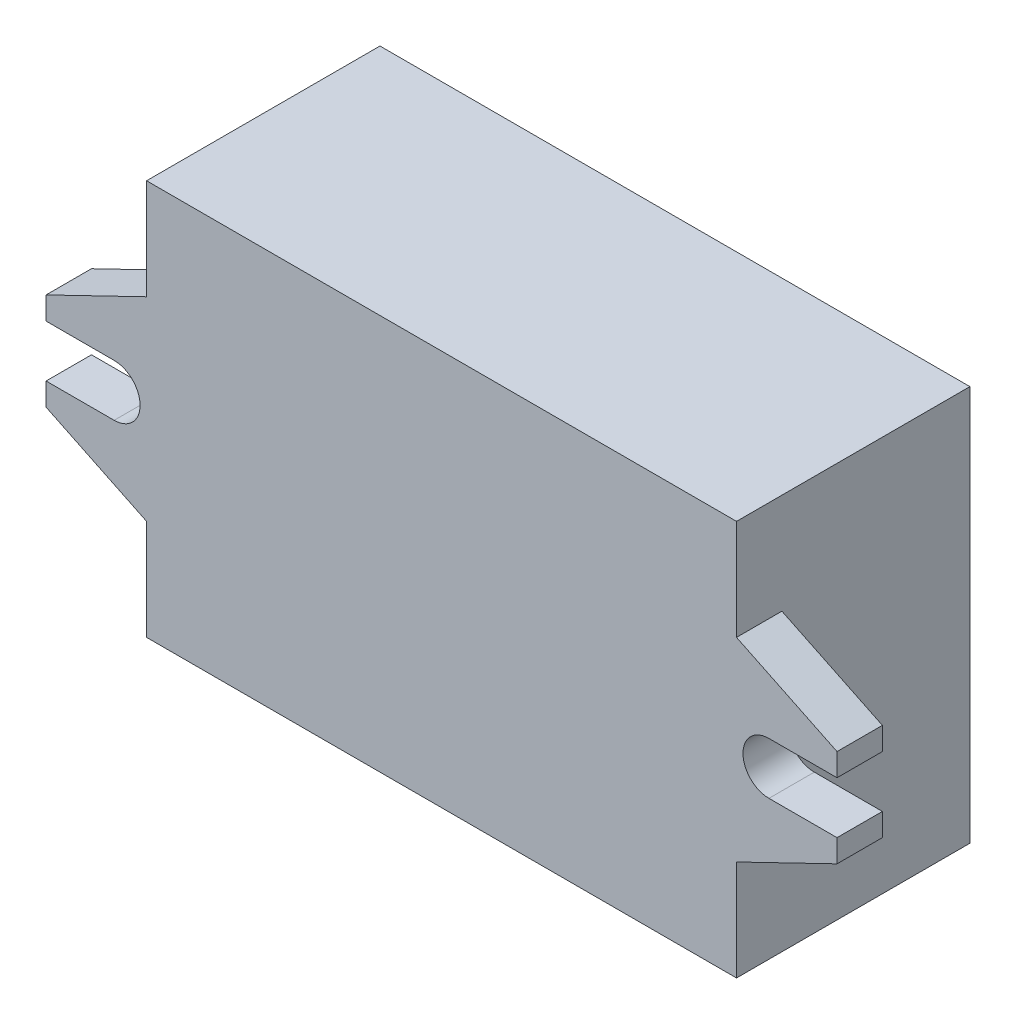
ISO-10303-21;
HEADER;
FILE_DESCRIPTION(('STEP AP214'),'2;1');
FILE_NAME('part.step','',(''),(''),'','','');
FILE_SCHEMA(('AUTOMOTIVE_DESIGN { 1 0 10303 214 1 1 1 1 }'));
ENDSEC;
DATA;
#1=APPLICATION_CONTEXT('core data for automotive mechanical design processes');
#2=APPLICATION_PROTOCOL_DEFINITION('international standard','automotive_design',2000,#1);
#3=PRODUCT_CONTEXT('',#1,'mechanical');
#4=PRODUCT('Part','Part','',(#3));
#5=PRODUCT_RELATED_PRODUCT_CATEGORY('part','',(#4));
#6=PRODUCT_DEFINITION_FORMATION('','',#4);
#7=PRODUCT_DEFINITION_CONTEXT('part definition',#1,'design');
#8=PRODUCT_DEFINITION('design','',#6,#7);
#9=PRODUCT_DEFINITION_SHAPE('','',#8);
#10=(LENGTH_UNIT() NAMED_UNIT(*) SI_UNIT(.MILLI.,.METRE.));
#11=(NAMED_UNIT(*) PLANE_ANGLE_UNIT() SI_UNIT($,.RADIAN.));
#12=(NAMED_UNIT(*) SI_UNIT($,.STERADIAN.) SOLID_ANGLE_UNIT());
#13=UNCERTAINTY_MEASURE_WITH_UNIT(LENGTH_MEASURE(1.E-05),#10,'distance_accuracy_value','');
#14=(GEOMETRIC_REPRESENTATION_CONTEXT(3) GLOBAL_UNCERTAINTY_ASSIGNED_CONTEXT((#13)) GLOBAL_UNIT_ASSIGNED_CONTEXT((#10,
#11,#12)) REPRESENTATION_CONTEXT('',''));
#15=CARTESIAN_POINT('',(0.,0.,0.));
#16=DIRECTION('',(0.,0.,1.));
#17=DIRECTION('',(1.,0.,0.));
#18=AXIS2_PLACEMENT_3D('',#15,#16,#17);
#19=CARTESIAN_POINT('',(0.,30.988,18.288));
#20=DIRECTION('',(1.,0.,0.));
#21=DIRECTION('',(0.,0.,-1.));
#22=AXIS2_PLACEMENT_3D('',#19,#20,#21);
#23=PLANE('',#22);
#24=DIRECTION('',(0.,0.,1.));
#25=VECTOR('',#24,1.);
#26=CARTESIAN_POINT('',(0.,7.874,14.732));
#27=LINE('',#26,#25);
#28=CARTESIAN_POINT('',(0.,7.874,14.732));
#29=VERTEX_POINT('',#28);
#30=CARTESIAN_POINT('',(0.,7.874,18.288));
#31=VERTEX_POINT('',#30);
#32=EDGE_CURVE('E230',#29,#31,#27,.T.);
#33=ORIENTED_EDGE('',*,*,#32,.F.);
#34=DIRECTION('',(0.,1.,0.));
#35=VECTOR('',#34,1.);
#36=CARTESIAN_POINT('',(0.,23.114,14.732));
#37=LINE('',#36,#35);
#38=CARTESIAN_POINT('',(0.,23.114,14.732));
#39=VERTEX_POINT('',#38);
#40=EDGE_CURVE('E179',#29,#39,#37,.T.);
#41=ORIENTED_EDGE('',*,*,#40,.T.);
#42=DIRECTION('',(0.,0.,1.));
#43=VECTOR('',#42,1.);
#44=CARTESIAN_POINT('',(0.,23.114,14.732));
#45=LINE('',#44,#43);
#46=CARTESIAN_POINT('',(0.,23.114,18.288));
#47=VERTEX_POINT('',#46);
#48=EDGE_CURVE('E193',#39,#47,#45,.T.);
#49=ORIENTED_EDGE('',*,*,#48,.T.);
#50=DIRECTION('',(0.,-1.,0.));
#51=VECTOR('',#50,1.);
#52=CARTESIAN_POINT('',(0.,30.988,18.288));
#53=LINE('',#52,#51);
#54=CARTESIAN_POINT('',(0.,30.988,18.288));
#55=VERTEX_POINT('',#54);
#56=EDGE_CURVE('E321',#55,#47,#53,.T.);
#57=ORIENTED_EDGE('',*,*,#56,.F.);
#58=DIRECTION('',(0.,0.,-1.));
#59=VECTOR('',#58,1.);
#60=CARTESIAN_POINT('',(0.,30.988,18.288));
#61=LINE('',#60,#59);
#62=CARTESIAN_POINT('',(0.,30.988,0.));
#63=VERTEX_POINT('',#62);
#64=EDGE_CURVE('E336',#55,#63,#61,.T.);
#65=ORIENTED_EDGE('',*,*,#64,.T.);
#66=DIRECTION('',(0.,-1.,0.));
#67=VECTOR('',#66,1.);
#68=CARTESIAN_POINT('',(0.,30.988,0.));
#69=LINE('',#68,#67);
#70=CARTESIAN_POINT('',(0.,0.,0.));
#71=VERTEX_POINT('',#70);
#72=EDGE_CURVE('E314',#63,#71,#69,.T.);
#73=ORIENTED_EDGE('',*,*,#72,.T.);
#74=DIRECTION('',(0.,0.,-1.));
#75=VECTOR('',#74,1.);
#76=CARTESIAN_POINT('',(0.,0.,18.288));
#77=LINE('',#76,#75);
#78=CARTESIAN_POINT('',(0.,0.,18.288));
#79=VERTEX_POINT('',#78);
#80=EDGE_CURVE('E11',#79,#71,#77,.T.);
#81=ORIENTED_EDGE('',*,*,#80,.F.);
#82=EDGE_CURVE('E325',#31,#79,#53,.T.);
#83=ORIENTED_EDGE('',*,*,#82,.F.);
#84=EDGE_LOOP('',(#33,#41,#49,#57,#65,#73,#81,#83));
#85=FACE_BOUND('',#84,.T.);
#86=ADVANCED_FACE('F33',(#85),#23,.F.);
#87=CARTESIAN_POINT('',(46.228,30.988,18.288));
#88=DIRECTION('',(-1.,0.,0.));
#89=DIRECTION('',(0.,0.,1.));
#90=AXIS2_PLACEMENT_3D('',#87,#88,#89);
#91=PLANE('',#90);
#92=DIRECTION('',(0.,0.,1.));
#93=VECTOR('',#92,1.);
#94=CARTESIAN_POINT('',(46.228,23.114,14.732));
#95=LINE('',#94,#93);
#96=CARTESIAN_POINT('',(46.228,23.114,14.732));
#97=VERTEX_POINT('',#96);
#98=CARTESIAN_POINT('',(46.228,23.114,18.288));
#99=VERTEX_POINT('',#98);
#100=EDGE_CURVE('E292',#97,#99,#95,.T.);
#101=ORIENTED_EDGE('',*,*,#100,.F.);
#102=DIRECTION('',(0.,-1.,0.));
#103=VECTOR('',#102,1.);
#104=CARTESIAN_POINT('',(46.228,23.114,14.732));
#105=LINE('',#104,#103);
#106=CARTESIAN_POINT('',(46.228,7.874,14.732));
#107=VERTEX_POINT('',#106);
#108=EDGE_CURVE('E250',#97,#107,#105,.T.);
#109=ORIENTED_EDGE('',*,*,#108,.T.);
#110=DIRECTION('',(0.,0.,1.));
#111=VECTOR('',#110,1.);
#112=CARTESIAN_POINT('',(46.228,7.874,14.732));
#113=LINE('',#112,#111);
#114=CARTESIAN_POINT('',(46.228,7.874,18.288));
#115=VERTEX_POINT('',#114);
#116=EDGE_CURVE('E274',#107,#115,#113,.T.);
#117=ORIENTED_EDGE('',*,*,#116,.T.);
#118=DIRECTION('',(0.,1.,0.));
#119=VECTOR('',#118,1.);
#120=CARTESIAN_POINT('',(46.228,30.988,18.288));
#121=LINE('',#120,#119);
#122=CARTESIAN_POINT('',(46.228,0.,18.288));
#123=VERTEX_POINT('',#122);
#124=EDGE_CURVE('E569',#123,#115,#121,.T.);
#125=ORIENTED_EDGE('',*,*,#124,.F.);
#126=DIRECTION('',(0.,0.,-1.));
#127=VECTOR('',#126,1.);
#128=CARTESIAN_POINT('',(46.228,0.,18.288));
#129=LINE('',#128,#127);
#130=CARTESIAN_POINT('',(46.228,0.,0.));
#131=VERTEX_POINT('',#130);
#132=EDGE_CURVE('E41',#123,#131,#129,.T.);
#133=ORIENTED_EDGE('',*,*,#132,.T.);
#134=DIRECTION('',(0.,1.,0.));
#135=VECTOR('',#134,1.);
#136=CARTESIAN_POINT('',(46.228,30.988,0.));
#137=LINE('',#136,#135);
#138=CARTESIAN_POINT('',(46.228,30.988,0.));
#139=VERTEX_POINT('',#138);
#140=EDGE_CURVE('E584',#131,#139,#137,.T.);
#141=ORIENTED_EDGE('',*,*,#140,.T.);
#142=DIRECTION('',(0.,0.,-1.));
#143=VECTOR('',#142,1.);
#144=CARTESIAN_POINT('',(46.228,30.988,18.288));
#145=LINE('',#144,#143);
#146=CARTESIAN_POINT('',(46.228,30.988,18.288));
#147=VERTEX_POINT('',#146);
#148=EDGE_CURVE('E579',#147,#139,#145,.T.);
#149=ORIENTED_EDGE('',*,*,#148,.F.);
#150=EDGE_CURVE('E568',#99,#147,#121,.T.);
#151=ORIENTED_EDGE('',*,*,#150,.F.);
#152=EDGE_LOOP('',(#101,#109,#117,#125,#133,#141,#149,#151));
#153=FACE_BOUND('',#152,.T.);
#154=ADVANCED_FACE('F359',(#153),#91,.F.);
#155=CARTESIAN_POINT('',(0.,0.,18.288));
#156=DIRECTION('',(0.,1.,0.));
#157=DIRECTION('',(0.,0.,1.));
#158=AXIS2_PLACEMENT_3D('',#155,#156,#157);
#159=PLANE('',#158);
#160=DIRECTION('',(1.,0.,0.));
#161=VECTOR('',#160,1.);
#162=CARTESIAN_POINT('',(0.,0.,0.));
#163=LINE('',#162,#161);
#164=EDGE_CURVE('E564',#71,#131,#163,.T.);
#165=ORIENTED_EDGE('',*,*,#164,.T.);
#166=ORIENTED_EDGE('',*,*,#132,.F.);
#167=DIRECTION('',(1.,0.,0.));
#168=VECTOR('',#167,1.);
#169=CARTESIAN_POINT('',(0.,0.,18.288));
#170=LINE('',#169,#168);
#171=EDGE_CURVE('E324',#79,#123,#170,.T.);
#172=ORIENTED_EDGE('',*,*,#171,.F.);
#173=ORIENTED_EDGE('',*,*,#80,.T.);
#174=EDGE_LOOP('',(#165,#166,#172,#173));
#175=FACE_BOUND('',#174,.T.);
#176=ADVANCED_FACE('F363',(#175),#159,.F.);
#177=CARTESIAN_POINT('',(0.,30.988,18.288));
#178=DIRECTION('',(0.,-1.,0.));
#179=DIRECTION('',(1.,0.,0.));
#180=AXIS2_PLACEMENT_3D('',#177,#178,#179);
#181=PLANE('',#180);
#182=DIRECTION('',(-1.,0.,0.));
#183=VECTOR('',#182,1.);
#184=CARTESIAN_POINT('',(0.,30.988,0.));
#185=LINE('',#184,#183);
#186=EDGE_CURVE('E326',#139,#63,#185,.T.);
#187=ORIENTED_EDGE('',*,*,#186,.T.);
#188=ORIENTED_EDGE('',*,*,#64,.F.);
#189=DIRECTION('',(-1.,0.,0.));
#190=VECTOR('',#189,1.);
#191=CARTESIAN_POINT('',(0.,30.988,18.288));
#192=LINE('',#191,#190);
#193=EDGE_CURVE('E331',#147,#55,#192,.T.);
#194=ORIENTED_EDGE('',*,*,#193,.F.);
#195=ORIENTED_EDGE('',*,*,#148,.T.);
#196=EDGE_LOOP('',(#187,#188,#194,#195));
#197=FACE_BOUND('',#196,.T.);
#198=ADVANCED_FACE('F369',(#197),#181,.F.);
#199=CARTESIAN_POINT('',(0.,0.,18.288));
#200=DIRECTION('',(0.,0.,1.));
#201=DIRECTION('',(1.,0.,0.));
#202=AXIS2_PLACEMENT_3D('',#199,#200,#201);
#203=PLANE('',#202);
#204=ORIENTED_EDGE('',*,*,#56,.T.);
#205=DIRECTION('',(-0.900159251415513,-0.435560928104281,0.));
#206=VECTOR('',#205,1.);
#207=CARTESIAN_POINT('',(0.,23.114,18.288));
#208=LINE('',#207,#206);
#209=CARTESIAN_POINT('',(-7.87399999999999,19.304,18.288));
#210=VERTEX_POINT('',#209);
#211=EDGE_CURVE('E49',#47,#210,#208,.T.);
#212=ORIENTED_EDGE('',*,*,#211,.T.);
#213=DIRECTION('',(0.,-1.,0.));
#214=VECTOR('',#213,1.);
#215=CARTESIAN_POINT('',(-7.87399999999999,19.304,18.288));
#216=LINE('',#215,#214);
#217=CARTESIAN_POINT('',(-7.87399999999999,17.526,18.288));
#218=VERTEX_POINT('',#217);
#219=EDGE_CURVE('E176',#210,#218,#216,.T.);
#220=ORIENTED_EDGE('',*,*,#219,.T.);
#221=DIRECTION('',(1.,0.,0.));
#222=VECTOR('',#221,1.);
#223=CARTESIAN_POINT('',(-7.87399999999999,17.526,18.288));
#224=LINE('',#223,#222);
#225=CARTESIAN_POINT('',(-2.54000000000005,17.526,18.288));
#226=VERTEX_POINT('',#225);
#227=EDGE_CURVE('E212',#218,#226,#224,.T.);
#228=ORIENTED_EDGE('',*,*,#227,.T.);
#229=CARTESIAN_POINT('',(-2.54000000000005,15.494,18.288));
#230=DIRECTION('',(0.,0.,-1.));
#231=DIRECTION('',(-1.,0.,0.));
#232=AXIS2_PLACEMENT_3D('',#229,#230,#231);
#233=CIRCLE('',#232,2.03200000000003);
#234=CARTESIAN_POINT('',(-2.54000000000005,13.462,18.288));
#235=VERTEX_POINT('',#234);
#236=EDGE_CURVE('E215',#226,#235,#233,.T.);
#237=ORIENTED_EDGE('',*,*,#236,.T.);
#238=DIRECTION('',(-1.,0.,0.));
#239=VECTOR('',#238,1.);
#240=CARTESIAN_POINT('',(-7.87399999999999,13.462,18.288));
#241=LINE('',#240,#239);
#242=CARTESIAN_POINT('',(-7.87399999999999,13.462,18.288));
#243=VERTEX_POINT('',#242);
#244=EDGE_CURVE('E218',#235,#243,#241,.T.);
#245=ORIENTED_EDGE('',*,*,#244,.T.);
#246=DIRECTION('',(0.,-1.,0.));
#247=VECTOR('',#246,1.);
#248=CARTESIAN_POINT('',(-7.87399999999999,11.684,18.288));
#249=LINE('',#248,#247);
#250=CARTESIAN_POINT('',(-7.87399999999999,11.684,18.288));
#251=VERTEX_POINT('',#250);
#252=EDGE_CURVE('E197',#243,#251,#249,.T.);
#253=ORIENTED_EDGE('',*,*,#252,.T.);
#254=DIRECTION('',(0.900159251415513,-0.435560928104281,0.));
#255=VECTOR('',#254,1.);
#256=CARTESIAN_POINT('',(0.,7.874,18.288));
#257=LINE('',#256,#255);
#258=EDGE_CURVE('E194',#251,#31,#257,.T.);
#259=ORIENTED_EDGE('',*,*,#258,.T.);
#260=ORIENTED_EDGE('',*,*,#82,.T.);
#261=ORIENTED_EDGE('',*,*,#171,.T.);
#262=ORIENTED_EDGE('',*,*,#124,.T.);
#263=DIRECTION('',(0.900159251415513,0.435560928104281,0.));
#264=VECTOR('',#263,1.);
#265=CARTESIAN_POINT('',(46.228,7.874,18.288));
#266=LINE('',#265,#264);
#267=CARTESIAN_POINT('',(54.102,11.684,18.288));
#268=VERTEX_POINT('',#267);
#269=EDGE_CURVE('E57',#115,#268,#266,.T.);
#270=ORIENTED_EDGE('',*,*,#269,.T.);
#271=DIRECTION('',(0.,1.,0.));
#272=VECTOR('',#271,1.);
#273=CARTESIAN_POINT('',(54.102,11.684,18.288));
#274=LINE('',#273,#272);
#275=CARTESIAN_POINT('',(54.102,13.462,18.288));
#276=VERTEX_POINT('',#275);
#277=EDGE_CURVE('E275',#268,#276,#274,.T.);
#278=ORIENTED_EDGE('',*,*,#277,.T.);
#279=DIRECTION('',(-1.,0.,0.));
#280=VECTOR('',#279,1.);
#281=CARTESIAN_POINT('',(54.102,13.462,18.288));
#282=LINE('',#281,#280);
#283=CARTESIAN_POINT('',(48.768,13.462,18.288));
#284=VERTEX_POINT('',#283);
#285=EDGE_CURVE('E278',#276,#284,#282,.T.);
#286=ORIENTED_EDGE('',*,*,#285,.T.);
#287=CARTESIAN_POINT('',(48.768,15.494,18.288));
#288=DIRECTION('',(0.,0.,-1.));
#289=DIRECTION('',(-1.,0.,0.));
#290=AXIS2_PLACEMENT_3D('',#287,#288,#289);
#291=CIRCLE('',#290,2.03200000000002);
#292=CARTESIAN_POINT('',(48.768,17.526,18.288));
#293=VERTEX_POINT('',#292);
#294=EDGE_CURVE('E281',#284,#293,#291,.T.);
#295=ORIENTED_EDGE('',*,*,#294,.T.);
#296=DIRECTION('',(1.,0.,0.));
#297=VECTOR('',#296,1.);
#298=CARTESIAN_POINT('',(54.102,17.526,18.288));
#299=LINE('',#298,#297);
#300=CARTESIAN_POINT('',(54.102,17.526,18.288));
#301=VERTEX_POINT('',#300);
#302=EDGE_CURVE('E284',#293,#301,#299,.T.);
#303=ORIENTED_EDGE('',*,*,#302,.T.);
#304=DIRECTION('',(0.,1.,0.));
#305=VECTOR('',#304,1.);
#306=CARTESIAN_POINT('',(54.102,19.304,18.288));
#307=LINE('',#306,#305);
#308=CARTESIAN_POINT('',(54.102,19.304,18.288));
#309=VERTEX_POINT('',#308);
#310=EDGE_CURVE('E287',#301,#309,#307,.T.);
#311=ORIENTED_EDGE('',*,*,#310,.T.);
#312=DIRECTION('',(-0.900159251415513,0.435560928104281,0.));
#313=VECTOR('',#312,1.);
#314=CARTESIAN_POINT('',(46.228,23.114,18.288));
#315=LINE('',#314,#313);
#316=EDGE_CURVE('E254',#309,#99,#315,.T.);
#317=ORIENTED_EDGE('',*,*,#316,.T.);
#318=ORIENTED_EDGE('',*,*,#150,.T.);
#319=ORIENTED_EDGE('',*,*,#193,.T.);
#320=EDGE_LOOP('',(#204,#212,#220,#228,#237,#245,#253,#259,#260,#261,#262,#270,#278,#286,#295,
#303,#311,#317,#318,#319));
#321=FACE_BOUND('',#320,.T.);
#322=ADVANCED_FACE('F328',(#321),#203,.T.);
#323=CARTESIAN_POINT('',(0.,0.,0.));
#324=DIRECTION('',(0.,0.,1.));
#325=DIRECTION('',(1.,0.,0.));
#326=AXIS2_PLACEMENT_3D('',#323,#324,#325);
#327=PLANE('',#326);
#328=ORIENTED_EDGE('',*,*,#72,.F.);
#329=ORIENTED_EDGE('',*,*,#186,.F.);
#330=ORIENTED_EDGE('',*,*,#140,.F.);
#331=ORIENTED_EDGE('',*,*,#164,.F.);
#332=EDGE_LOOP('',(#328,#329,#330,#331));
#333=FACE_BOUND('',#332,.T.);
#334=ADVANCED_FACE('F376',(#333),#327,.F.);
#335=CARTESIAN_POINT('',(46.228,23.114,14.732));
#336=DIRECTION('',(0.435560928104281,0.900159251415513,0.));
#337=DIRECTION('',(-0.900159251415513,0.435560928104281,0.));
#338=AXIS2_PLACEMENT_3D('',#335,#336,#337);
#339=PLANE('',#338);
#340=ORIENTED_EDGE('',*,*,#316,.F.);
#341=DIRECTION('',(0.,0.,1.));
#342=VECTOR('',#341,1.);
#343=CARTESIAN_POINT('',(54.102,19.304,14.732));
#344=LINE('',#343,#342);
#345=CARTESIAN_POINT('',(54.102,19.304,14.732));
#346=VERTEX_POINT('',#345);
#347=EDGE_CURVE('E290',#346,#309,#344,.T.);
#348=ORIENTED_EDGE('',*,*,#347,.F.);
#349=DIRECTION('',(-0.900159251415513,0.435560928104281,0.));
#350=VECTOR('',#349,1.);
#351=CARTESIAN_POINT('',(46.228,23.114,14.732));
#352=LINE('',#351,#350);
#353=EDGE_CURVE('E271',#346,#97,#352,.T.);
#354=ORIENTED_EDGE('',*,*,#353,.T.);
#355=ORIENTED_EDGE('',*,*,#100,.T.);
#356=EDGE_LOOP('',(#340,#348,#354,#355));
#357=FACE_BOUND('',#356,.T.);
#358=ADVANCED_FACE('F379',(#357),#339,.T.);
#359=CARTESIAN_POINT('',(54.102,19.304,14.732));
#360=DIRECTION('',(1.,0.,0.));
#361=DIRECTION('',(0.,0.,-1.));
#362=AXIS2_PLACEMENT_3D('',#359,#360,#361);
#363=PLANE('',#362);
#364=ORIENTED_EDGE('',*,*,#310,.F.);
#365=DIRECTION('',(0.,0.,1.));
#366=VECTOR('',#365,1.);
#367=CARTESIAN_POINT('',(54.102,17.526,14.732));
#368=LINE('',#367,#366);
#369=CARTESIAN_POINT('',(54.102,17.526,14.732));
#370=VERTEX_POINT('',#369);
#371=EDGE_CURVE('E293',#370,#301,#368,.T.);
#372=ORIENTED_EDGE('',*,*,#371,.F.);
#373=DIRECTION('',(0.,1.,0.));
#374=VECTOR('',#373,1.);
#375=CARTESIAN_POINT('',(54.102,19.304,14.732));
#376=LINE('',#375,#374);
#377=EDGE_CURVE('E268',#370,#346,#376,.T.);
#378=ORIENTED_EDGE('',*,*,#377,.T.);
#379=ORIENTED_EDGE('',*,*,#347,.T.);
#380=EDGE_LOOP('',(#364,#372,#378,#379));
#381=FACE_BOUND('',#380,.T.);
#382=ADVANCED_FACE('F402',(#381),#363,.T.);
#383=CARTESIAN_POINT('',(54.102,17.526,14.732));
#384=DIRECTION('',(0.,-1.,0.));
#385=DIRECTION('',(0.,0.,-1.));
#386=AXIS2_PLACEMENT_3D('',#383,#384,#385);
#387=PLANE('',#386);
#388=ORIENTED_EDGE('',*,*,#302,.F.);
#389=DIRECTION('',(0.,0.,1.));
#390=VECTOR('',#389,1.);
#391=CARTESIAN_POINT('',(48.768,17.526,14.732));
#392=LINE('',#391,#390);
#393=CARTESIAN_POINT('',(48.768,17.526,14.732));
#394=VERTEX_POINT('',#393);
#395=EDGE_CURVE('E295',#394,#293,#392,.T.);
#396=ORIENTED_EDGE('',*,*,#395,.F.);
#397=DIRECTION('',(1.,0.,0.));
#398=VECTOR('',#397,1.);
#399=CARTESIAN_POINT('',(54.102,17.526,14.732));
#400=LINE('',#399,#398);
#401=EDGE_CURVE('E265',#394,#370,#400,.T.);
#402=ORIENTED_EDGE('',*,*,#401,.T.);
#403=ORIENTED_EDGE('',*,*,#371,.T.);
#404=EDGE_LOOP('',(#388,#396,#402,#403));
#405=FACE_BOUND('',#404,.T.);
#406=ADVANCED_FACE('F398',(#405),#387,.T.);
#407=CARTESIAN_POINT('',(48.768,15.494,14.732));
#408=DIRECTION('',(0.,0.,1.));
#409=DIRECTION('',(1.,0.,0.));
#410=AXIS2_PLACEMENT_3D('',#407,#408,#409);
#411=CYLINDRICAL_SURFACE('',#410,2.03200000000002);
#412=ORIENTED_EDGE('',*,*,#294,.F.);
#413=DIRECTION('',(0.,0.,1.));
#414=VECTOR('',#413,1.);
#415=CARTESIAN_POINT('',(48.768,13.462,14.732));
#416=LINE('',#415,#414);
#417=CARTESIAN_POINT('',(48.768,13.462,14.732));
#418=VERTEX_POINT('',#417);
#419=EDGE_CURVE('E297',#418,#284,#416,.T.);
#420=ORIENTED_EDGE('',*,*,#419,.F.);
#421=CARTESIAN_POINT('',(48.768,15.494,14.732));
#422=DIRECTION('',(0.,0.,-1.));
#423=DIRECTION('',(1.,0.,0.));
#424=AXIS2_PLACEMENT_3D('',#421,#422,#423);
#425=CIRCLE('',#424,2.03200000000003);
#426=EDGE_CURVE('E263',#418,#394,#425,.T.);
#427=ORIENTED_EDGE('',*,*,#426,.T.);
#428=ORIENTED_EDGE('',*,*,#395,.T.);
#429=EDGE_LOOP('',(#412,#420,#427,#428));
#430=FACE_BOUND('',#429,.T.);
#431=ADVANCED_FACE('F394',(#430),#411,.F.);
#432=CARTESIAN_POINT('',(54.102,13.462,14.732));
#433=DIRECTION('',(0.,1.,0.));
#434=DIRECTION('',(0.,0.,1.));
#435=AXIS2_PLACEMENT_3D('',#432,#433,#434);
#436=PLANE('',#435);
#437=ORIENTED_EDGE('',*,*,#285,.F.);
#438=DIRECTION('',(0.,0.,1.));
#439=VECTOR('',#438,1.);
#440=CARTESIAN_POINT('',(54.102,13.462,14.732));
#441=LINE('',#440,#439);
#442=CARTESIAN_POINT('',(54.102,13.462,14.732));
#443=VERTEX_POINT('',#442);
#444=EDGE_CURVE('E300',#443,#276,#441,.T.);
#445=ORIENTED_EDGE('',*,*,#444,.F.);
#446=DIRECTION('',(-1.,0.,0.));
#447=VECTOR('',#446,1.);
#448=CARTESIAN_POINT('',(54.102,13.462,14.732));
#449=LINE('',#448,#447);
#450=EDGE_CURVE('E260',#443,#418,#449,.T.);
#451=ORIENTED_EDGE('',*,*,#450,.T.);
#452=ORIENTED_EDGE('',*,*,#419,.T.);
#453=EDGE_LOOP('',(#437,#445,#451,#452));
#454=FACE_BOUND('',#453,.T.);
#455=ADVANCED_FACE('F390',(#454),#436,.T.);
#456=CARTESIAN_POINT('',(54.102,11.684,14.732));
#457=DIRECTION('',(1.,0.,0.));
#458=DIRECTION('',(0.,0.,-1.));
#459=AXIS2_PLACEMENT_3D('',#456,#457,#458);
#460=PLANE('',#459);
#461=ORIENTED_EDGE('',*,*,#277,.F.);
#462=DIRECTION('',(0.,0.,1.));
#463=VECTOR('',#462,1.);
#464=CARTESIAN_POINT('',(54.102,11.684,14.732));
#465=LINE('',#464,#463);
#466=CARTESIAN_POINT('',(54.102,11.684,14.732));
#467=VERTEX_POINT('',#466);
#468=EDGE_CURVE('E302',#467,#268,#465,.T.);
#469=ORIENTED_EDGE('',*,*,#468,.F.);
#470=DIRECTION('',(0.,1.,0.));
#471=VECTOR('',#470,1.);
#472=CARTESIAN_POINT('',(54.102,11.684,14.732));
#473=LINE('',#472,#471);
#474=EDGE_CURVE('E257',#467,#443,#473,.T.);
#475=ORIENTED_EDGE('',*,*,#474,.T.);
#476=ORIENTED_EDGE('',*,*,#444,.T.);
#477=EDGE_LOOP('',(#461,#469,#475,#476));
#478=FACE_BOUND('',#477,.T.);
#479=ADVANCED_FACE('F387',(#478),#460,.T.);
#480=CARTESIAN_POINT('',(46.228,7.874,14.732));
#481=DIRECTION('',(0.435560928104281,-0.900159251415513,0.));
#482=DIRECTION('',(0.900159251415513,0.435560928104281,0.));
#483=AXIS2_PLACEMENT_3D('',#480,#481,#482);
#484=PLANE('',#483);
#485=ORIENTED_EDGE('',*,*,#269,.F.);
#486=ORIENTED_EDGE('',*,*,#116,.F.);
#487=DIRECTION('',(0.900159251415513,0.435560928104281,0.));
#488=VECTOR('',#487,1.);
#489=CARTESIAN_POINT('',(46.228,7.874,14.732));
#490=LINE('',#489,#488);
#491=EDGE_CURVE('E253',#107,#467,#490,.T.);
#492=ORIENTED_EDGE('',*,*,#491,.T.);
#493=ORIENTED_EDGE('',*,*,#468,.T.);
#494=EDGE_LOOP('',(#485,#486,#492,#493));
#495=FACE_BOUND('',#494,.T.);
#496=ADVANCED_FACE('F383',(#495),#484,.T.);
#497=CARTESIAN_POINT('',(48.768,15.494,14.732));
#498=DIRECTION('',(0.,0.,1.));
#499=DIRECTION('',(1.,0.,0.));
#500=AXIS2_PLACEMENT_3D('',#497,#498,#499);
#501=PLANE('',#500);
#502=ORIENTED_EDGE('',*,*,#108,.F.);
#503=ORIENTED_EDGE('',*,*,#353,.F.);
#504=ORIENTED_EDGE('',*,*,#377,.F.);
#505=ORIENTED_EDGE('',*,*,#401,.F.);
#506=ORIENTED_EDGE('',*,*,#426,.F.);
#507=ORIENTED_EDGE('',*,*,#450,.F.);
#508=ORIENTED_EDGE('',*,*,#474,.F.);
#509=ORIENTED_EDGE('',*,*,#491,.F.);
#510=EDGE_LOOP('',(#502,#503,#504,#505,#506,#507,#508,#509));
#511=FACE_BOUND('',#510,.T.);
#512=ADVANCED_FACE('F386',(#511),#501,.F.);
#513=CARTESIAN_POINT('',(0.,23.114,14.732));
#514=DIRECTION('',(-0.435560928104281,0.900159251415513,0.));
#515=DIRECTION('',(-0.900159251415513,-0.435560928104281,0.));
#516=AXIS2_PLACEMENT_3D('',#513,#514,#515);
#517=PLANE('',#516);
#518=ORIENTED_EDGE('',*,*,#211,.F.);
#519=ORIENTED_EDGE('',*,*,#48,.F.);
#520=DIRECTION('',(-0.900159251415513,-0.435560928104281,0.));
#521=VECTOR('',#520,1.);
#522=CARTESIAN_POINT('',(0.,23.114,14.732));
#523=LINE('',#522,#521);
#524=CARTESIAN_POINT('',(-7.87399999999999,19.304,14.732));
#525=VERTEX_POINT('',#524);
#526=EDGE_CURVE('E186',#39,#525,#523,.T.);
#527=ORIENTED_EDGE('',*,*,#526,.T.);
#528=DIRECTION('',(0.,0.,1.));
#529=VECTOR('',#528,1.);
#530=CARTESIAN_POINT('',(-7.87399999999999,19.304,14.732));
#531=LINE('',#530,#529);
#532=EDGE_CURVE('E171',#525,#210,#531,.T.);
#533=ORIENTED_EDGE('',*,*,#532,.T.);
#534=EDGE_LOOP('',(#518,#519,#527,#533));
#535=FACE_BOUND('',#534,.T.);
#536=ADVANCED_FACE('F192',(#535),#517,.T.);
#537=CARTESIAN_POINT('',(0.,7.874,14.732));
#538=DIRECTION('',(-0.435560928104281,-0.900159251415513,0.));
#539=DIRECTION('',(0.900159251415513,-0.435560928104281,0.));
#540=AXIS2_PLACEMENT_3D('',#537,#538,#539);
#541=PLANE('',#540);
#542=ORIENTED_EDGE('',*,*,#258,.F.);
#543=DIRECTION('',(0.,0.,1.));
#544=VECTOR('',#543,1.);
#545=CARTESIAN_POINT('',(-7.87399999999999,11.684,14.732));
#546=LINE('',#545,#544);
#547=CARTESIAN_POINT('',(-7.87399999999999,11.684,14.732));
#548=VERTEX_POINT('',#547);
#549=EDGE_CURVE('E225',#548,#251,#546,.T.);
#550=ORIENTED_EDGE('',*,*,#549,.F.);
#551=DIRECTION('',(0.900159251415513,-0.435560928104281,0.));
#552=VECTOR('',#551,1.);
#553=CARTESIAN_POINT('',(0.,7.874,14.732));
#554=LINE('',#553,#552);
#555=EDGE_CURVE('E208',#548,#29,#554,.T.);
#556=ORIENTED_EDGE('',*,*,#555,.T.);
#557=ORIENTED_EDGE('',*,*,#32,.T.);
#558=EDGE_LOOP('',(#542,#550,#556,#557));
#559=FACE_BOUND('',#558,.T.);
#560=ADVANCED_FACE('F415',(#559),#541,.T.);
#561=CARTESIAN_POINT('',(-7.87399999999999,11.684,14.732));
#562=DIRECTION('',(-1.,0.,0.));
#563=DIRECTION('',(0.,0.,1.));
#564=AXIS2_PLACEMENT_3D('',#561,#562,#563);
#565=PLANE('',#564);
#566=ORIENTED_EDGE('',*,*,#252,.F.);
#567=DIRECTION('',(0.,0.,1.));
#568=VECTOR('',#567,1.);
#569=CARTESIAN_POINT('',(-7.87399999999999,13.462,14.732));
#570=LINE('',#569,#568);
#571=CARTESIAN_POINT('',(-7.87399999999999,13.462,14.732));
#572=VERTEX_POINT('',#571);
#573=EDGE_CURVE('E238',#572,#243,#570,.T.);
#574=ORIENTED_EDGE('',*,*,#573,.F.);
#575=DIRECTION('',(0.,-1.,0.));
#576=VECTOR('',#575,1.);
#577=CARTESIAN_POINT('',(-7.87399999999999,11.684,14.732));
#578=LINE('',#577,#576);
#579=EDGE_CURVE('E205',#572,#548,#578,.T.);
#580=ORIENTED_EDGE('',*,*,#579,.T.);
#581=ORIENTED_EDGE('',*,*,#549,.T.);
#582=EDGE_LOOP('',(#566,#574,#580,#581));
#583=FACE_BOUND('',#582,.T.);
#584=ADVANCED_FACE('F342',(#583),#565,.T.);
#585=CARTESIAN_POINT('',(-7.87399999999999,13.462,14.732));
#586=DIRECTION('',(0.,1.,0.));
#587=DIRECTION('',(0.,0.,1.));
#588=AXIS2_PLACEMENT_3D('',#585,#586,#587);
#589=PLANE('',#588);
#590=ORIENTED_EDGE('',*,*,#244,.F.);
#591=DIRECTION('',(0.,0.,1.));
#592=VECTOR('',#591,1.);
#593=CARTESIAN_POINT('',(-2.54000000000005,13.462,14.732));
#594=LINE('',#593,#592);
#595=CARTESIAN_POINT('',(-2.54000000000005,13.462,14.732));
#596=VERTEX_POINT('',#595);
#597=EDGE_CURVE('E241',#596,#235,#594,.T.);
#598=ORIENTED_EDGE('',*,*,#597,.F.);
#599=DIRECTION('',(-1.,0.,0.));
#600=VECTOR('',#599,1.);
#601=CARTESIAN_POINT('',(-7.87399999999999,13.462,14.732));
#602=LINE('',#601,#600);
#603=EDGE_CURVE('E202',#596,#572,#602,.T.);
#604=ORIENTED_EDGE('',*,*,#603,.T.);
#605=ORIENTED_EDGE('',*,*,#573,.T.);
#606=EDGE_LOOP('',(#590,#598,#604,#605));
#607=FACE_BOUND('',#606,.T.);
#608=ADVANCED_FACE('F344',(#607),#589,.T.);
#609=CARTESIAN_POINT('',(-2.54000000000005,15.494,14.732));
#610=DIRECTION('',(0.,0.,1.));
#611=DIRECTION('',(1.,0.,0.));
#612=AXIS2_PLACEMENT_3D('',#609,#610,#611);
#613=CYLINDRICAL_SURFACE('',#612,2.03200000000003);
#614=ORIENTED_EDGE('',*,*,#236,.F.);
#615=DIRECTION('',(0.,0.,1.));
#616=VECTOR('',#615,1.);
#617=CARTESIAN_POINT('',(-2.54000000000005,17.526,14.732));
#618=LINE('',#617,#616);
#619=CARTESIAN_POINT('',(-2.54000000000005,17.526,14.732));
#620=VERTEX_POINT('',#619);
#621=EDGE_CURVE('E244',#620,#226,#618,.T.);
#622=ORIENTED_EDGE('',*,*,#621,.F.);
#623=CARTESIAN_POINT('',(-2.54000000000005,15.494,14.732));
#624=DIRECTION('',(0.,0.,-1.));
#625=DIRECTION('',(1.,0.,0.));
#626=AXIS2_PLACEMENT_3D('',#623,#624,#625);
#627=CIRCLE('',#626,2.03200000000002);
#628=EDGE_CURVE('E200',#620,#596,#627,.T.);
#629=ORIENTED_EDGE('',*,*,#628,.T.);
#630=ORIENTED_EDGE('',*,*,#597,.T.);
#631=EDGE_LOOP('',(#614,#622,#629,#630));
#632=FACE_BOUND('',#631,.T.);
#633=ADVANCED_FACE('F349',(#632),#613,.F.);
#634=CARTESIAN_POINT('',(-7.87399999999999,17.526,14.732));
#635=DIRECTION('',(0.,-1.,0.));
#636=DIRECTION('',(0.,0.,-1.));
#637=AXIS2_PLACEMENT_3D('',#634,#635,#636);
#638=PLANE('',#637);
#639=ORIENTED_EDGE('',*,*,#227,.F.);
#640=DIRECTION('',(0.,0.,1.));
#641=VECTOR('',#640,1.);
#642=CARTESIAN_POINT('',(-7.87399999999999,17.526,14.732));
#643=LINE('',#642,#641);
#644=CARTESIAN_POINT('',(-7.87399999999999,17.526,14.732));
#645=VERTEX_POINT('',#644);
#646=EDGE_CURVE('E178',#645,#218,#643,.T.);
#647=ORIENTED_EDGE('',*,*,#646,.F.);
#648=DIRECTION('',(1.,0.,0.));
#649=VECTOR('',#648,1.);
#650=CARTESIAN_POINT('',(-7.87399999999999,17.526,14.732));
#651=LINE('',#650,#649);
#652=EDGE_CURVE('E190',#645,#620,#651,.T.);
#653=ORIENTED_EDGE('',*,*,#652,.T.);
#654=ORIENTED_EDGE('',*,*,#621,.T.);
#655=EDGE_LOOP('',(#639,#647,#653,#654));
#656=FACE_BOUND('',#655,.T.);
#657=ADVANCED_FACE('F348',(#656),#638,.T.);
#658=CARTESIAN_POINT('',(-7.87399999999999,19.304,14.732));
#659=DIRECTION('',(-1.,0.,0.));
#660=DIRECTION('',(0.,0.,1.));
#661=AXIS2_PLACEMENT_3D('',#658,#659,#660);
#662=PLANE('',#661);
#663=ORIENTED_EDGE('',*,*,#219,.F.);
#664=ORIENTED_EDGE('',*,*,#532,.F.);
#665=DIRECTION('',(0.,-1.,0.));
#666=VECTOR('',#665,1.);
#667=CARTESIAN_POINT('',(-7.87399999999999,19.304,14.732));
#668=LINE('',#667,#666);
#669=EDGE_CURVE('E174',#525,#645,#668,.T.);
#670=ORIENTED_EDGE('',*,*,#669,.T.);
#671=ORIENTED_EDGE('',*,*,#646,.T.);
#672=EDGE_LOOP('',(#663,#664,#670,#671));
#673=FACE_BOUND('',#672,.T.);
#674=ADVANCED_FACE('F173',(#673),#662,.T.);
#675=CARTESIAN_POINT('',(-2.54000000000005,15.494,14.732));
#676=DIRECTION('',(0.,0.,1.));
#677=DIRECTION('',(1.,0.,0.));
#678=AXIS2_PLACEMENT_3D('',#675,#676,#677);
#679=PLANE('',#678);
#680=ORIENTED_EDGE('',*,*,#526,.F.);
#681=ORIENTED_EDGE('',*,*,#40,.F.);
#682=ORIENTED_EDGE('',*,*,#555,.F.);
#683=ORIENTED_EDGE('',*,*,#579,.F.);
#684=ORIENTED_EDGE('',*,*,#603,.F.);
#685=ORIENTED_EDGE('',*,*,#628,.F.);
#686=ORIENTED_EDGE('',*,*,#652,.F.);
#687=ORIENTED_EDGE('',*,*,#669,.F.);
#688=EDGE_LOOP('',(#680,#681,#682,#683,#684,#685,#686,#687));
#689=FACE_BOUND('',#688,.T.);
#690=ADVANCED_FACE('F184',(#689),#679,.F.);
#691=CLOSED_SHELL('',(#86,#154,#176,#198,#322,#334,#358,#382,#406,#431,#455,#479,#496,#512,#536,
#560,#584,#608,#633,#657,#674,#690));
#692=MANIFOLD_SOLID_BREP('B2',#691);
#693=ADVANCED_BREP_SHAPE_REPRESENTATION('',(#18,#692),#14);
#694=SHAPE_DEFINITION_REPRESENTATION(#9,#693);
ENDSEC;
END-ISO-10303-21;
